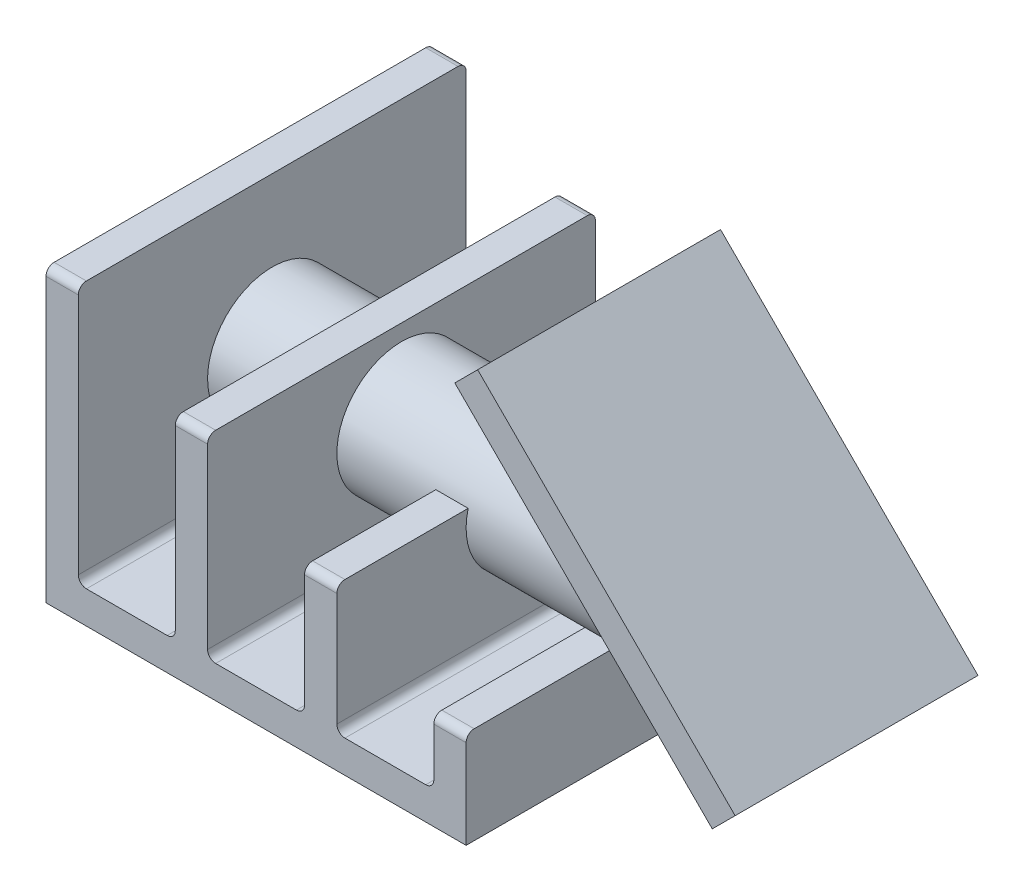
ISO-10303-21;
HEADER;
FILE_DESCRIPTION(('STEP AP214'),'2;1');
FILE_NAME('part.step','',(''),(''),'','','');
FILE_SCHEMA(('AUTOMOTIVE_DESIGN { 1 0 10303 214 1 1 1 1 }'));
ENDSEC;
DATA;
#1=APPLICATION_CONTEXT('core data for automotive mechanical design processes');
#2=APPLICATION_PROTOCOL_DEFINITION('international standard','automotive_design',2000,#1);
#3=PRODUCT_CONTEXT('',#1,'mechanical');
#4=PRODUCT('Part','Part','',(#3));
#5=PRODUCT_RELATED_PRODUCT_CATEGORY('part','',(#4));
#6=PRODUCT_DEFINITION_FORMATION('','',#4);
#7=PRODUCT_DEFINITION_CONTEXT('part definition',#1,'design');
#8=PRODUCT_DEFINITION('design','',#6,#7);
#9=PRODUCT_DEFINITION_SHAPE('','',#8);
#10=(LENGTH_UNIT() NAMED_UNIT(*) SI_UNIT(.MILLI.,.METRE.));
#11=(NAMED_UNIT(*) PLANE_ANGLE_UNIT() SI_UNIT($,.RADIAN.));
#12=(NAMED_UNIT(*) SI_UNIT($,.STERADIAN.) SOLID_ANGLE_UNIT());
#13=UNCERTAINTY_MEASURE_WITH_UNIT(LENGTH_MEASURE(1.E-05),#10,'distance_accuracy_value','');
#14=(GEOMETRIC_REPRESENTATION_CONTEXT(3) GLOBAL_UNCERTAINTY_ASSIGNED_CONTEXT((#13)) GLOBAL_UNIT_ASSIGNED_CONTEXT((#10,
#11,#12)) REPRESENTATION_CONTEXT('',''));
#15=CARTESIAN_POINT('',(0.,0.,0.));
#16=DIRECTION('',(0.,0.,1.));
#17=DIRECTION('',(1.,0.,0.));
#18=AXIS2_PLACEMENT_3D('',#15,#16,#17);
#19=CARTESIAN_POINT('',(140.268496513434,134.77355245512,-29.3702963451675));
#20=DIRECTION('',(0.,0.,-1.));
#21=DIRECTION('',(-1.,0.,0.));
#22=AXIS2_PLACEMENT_3D('',#19,#20,#21);
#23=PLANE('',#22);
#24=DIRECTION('',(0.707106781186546,-0.707106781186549,0.));
#25=VECTOR('',#24,1.);
#26=CARTESIAN_POINT('',(131.288240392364,125.793296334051,-29.3702963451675));
#27=LINE('',#26,#25);
#28=CARTESIAN_POINT('',(131.288240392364,125.793296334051,-29.3702963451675));
#29=VERTEX_POINT('',#28);
#30=CARTESIAN_POINT('',(232.47228169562,24.6092550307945,-29.3702963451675));
#31=VERTEX_POINT('',#30);
#32=EDGE_CURVE('E104',#29,#31,#27,.T.);
#33=ORIENTED_EDGE('',*,*,#32,.T.);
#34=DIRECTION('',(-0.707106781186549,-0.707106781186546,0.));
#35=VECTOR('',#34,1.);
#36=CARTESIAN_POINT('',(241.452537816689,33.5895111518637,-29.3702963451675));
#37=LINE('',#36,#35);
#38=CARTESIAN_POINT('',(241.452537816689,33.5895111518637,-29.3702963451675));
#39=VERTEX_POINT('',#38);
#40=EDGE_CURVE('E12',#39,#31,#37,.T.);
#41=ORIENTED_EDGE('',*,*,#40,.F.);
#42=DIRECTION('',(0.707106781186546,-0.707106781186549,0.));
#43=VECTOR('',#42,1.);
#44=CARTESIAN_POINT('',(140.268496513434,134.77355245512,-29.3702963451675));
#45=LINE('',#44,#43);
#46=CARTESIAN_POINT('',(140.268496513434,134.77355245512,-29.3702963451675));
#47=VERTEX_POINT('',#46);
#48=EDGE_CURVE('E92',#47,#39,#45,.T.);
#49=ORIENTED_EDGE('',*,*,#48,.F.);
#50=DIRECTION('',(-0.707106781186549,-0.707106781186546,0.));
#51=VECTOR('',#50,1.);
#52=CARTESIAN_POINT('',(140.268496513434,134.77355245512,-29.3702963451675));
#53=LINE('',#52,#51);
#54=EDGE_CURVE('E100',#47,#29,#53,.T.);
#55=ORIENTED_EDGE('',*,*,#54,.T.);
#56=EDGE_LOOP('',(#33,#41,#49,#55));
#57=FACE_BOUND('',#56,.T.);
#58=ADVANCED_FACE('F41',(#57),#23,.F.);
#59=CARTESIAN_POINT('',(241.452537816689,33.5895111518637,-29.3702963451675));
#60=DIRECTION('',(-0.707106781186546,0.707106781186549,0.));
#61=DIRECTION('',(-0.707106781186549,-0.707106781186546,0.));
#62=AXIS2_PLACEMENT_3D('',#59,#60,#61);
#63=PLANE('',#62);
#64=DIRECTION('',(0.,0.,-1.));
#65=VECTOR('',#64,1.);
#66=CARTESIAN_POINT('',(232.47228169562,24.6092550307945,-29.3702963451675));
#67=LINE('',#66,#65);
#68=CARTESIAN_POINT('',(232.47228169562,24.6092550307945,-124.813692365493));
#69=VERTEX_POINT('',#68);
#70=EDGE_CURVE('E96',#31,#69,#67,.T.);
#71=ORIENTED_EDGE('',*,*,#70,.T.);
#72=DIRECTION('',(-0.707106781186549,-0.707106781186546,0.));
#73=VECTOR('',#72,1.);
#74=CARTESIAN_POINT('',(241.452537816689,33.5895111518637,-124.813692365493));
#75=LINE('',#74,#73);
#76=CARTESIAN_POINT('',(241.452537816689,33.5895111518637,-124.813692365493));
#77=VERTEX_POINT('',#76);
#78=EDGE_CURVE('E49',#77,#69,#75,.T.);
#79=ORIENTED_EDGE('',*,*,#78,.F.);
#80=DIRECTION('',(0.,0.,-1.));
#81=VECTOR('',#80,1.);
#82=CARTESIAN_POINT('',(241.452537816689,33.5895111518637,-29.3702963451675));
#83=LINE('',#82,#81);
#84=EDGE_CURVE('E87',#39,#77,#83,.T.);
#85=ORIENTED_EDGE('',*,*,#84,.F.);
#86=ORIENTED_EDGE('',*,*,#40,.T.);
#87=EDGE_LOOP('',(#71,#79,#85,#86));
#88=FACE_BOUND('',#87,.T.);
#89=ADVANCED_FACE('F95',(#88),#63,.F.);
#90=CARTESIAN_POINT('',(140.268496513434,134.77355245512,-124.813692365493));
#91=DIRECTION('',(0.,0.,1.));
#92=DIRECTION('',(1.,0.,0.));
#93=AXIS2_PLACEMENT_3D('',#90,#91,#92);
#94=PLANE('',#93);
#95=DIRECTION('',(-0.707106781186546,0.707106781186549,0.));
#96=VECTOR('',#95,1.);
#97=CARTESIAN_POINT('',(131.288240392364,125.793296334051,-124.813692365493));
#98=LINE('',#97,#96);
#99=CARTESIAN_POINT('',(131.288240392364,125.793296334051,-124.813692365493));
#100=VERTEX_POINT('',#99);
#101=EDGE_CURVE('E74',#69,#100,#98,.T.);
#102=ORIENTED_EDGE('',*,*,#101,.T.);
#103=DIRECTION('',(-0.707106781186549,-0.707106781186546,0.));
#104=VECTOR('',#103,1.);
#105=CARTESIAN_POINT('',(140.268496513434,134.77355245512,-124.813692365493));
#106=LINE('',#105,#104);
#107=CARTESIAN_POINT('',(140.268496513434,134.77355245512,-124.813692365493));
#108=VERTEX_POINT('',#107);
#109=EDGE_CURVE('E97',#108,#100,#106,.T.);
#110=ORIENTED_EDGE('',*,*,#109,.F.);
#111=DIRECTION('',(-0.707106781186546,0.707106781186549,0.));
#112=VECTOR('',#111,1.);
#113=CARTESIAN_POINT('',(140.268496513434,134.77355245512,-124.813692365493));
#114=LINE('',#113,#112);
#115=EDGE_CURVE('E90',#77,#108,#114,.T.);
#116=ORIENTED_EDGE('',*,*,#115,.F.);
#117=ORIENTED_EDGE('',*,*,#78,.T.);
#118=EDGE_LOOP('',(#102,#110,#116,#117));
#119=FACE_BOUND('',#118,.T.);
#120=ADVANCED_FACE('F98',(#119),#94,.F.);
#121=CARTESIAN_POINT('',(140.268496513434,134.77355245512,-29.3702963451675));
#122=DIRECTION('',(0.707106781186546,-0.707106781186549,0.));
#123=DIRECTION('',(0.707106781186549,0.707106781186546,0.));
#124=AXIS2_PLACEMENT_3D('',#121,#122,#123);
#125=PLANE('',#124);
#126=DIRECTION('',(0.,0.,1.));
#127=VECTOR('',#126,1.);
#128=CARTESIAN_POINT('',(131.288240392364,125.793296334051,-29.3702963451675));
#129=LINE('',#128,#127);
#130=EDGE_CURVE('E80',#100,#29,#129,.T.);
#131=ORIENTED_EDGE('',*,*,#130,.T.);
#132=ORIENTED_EDGE('',*,*,#54,.F.);
#133=DIRECTION('',(0.,0.,1.));
#134=VECTOR('',#133,1.);
#135=CARTESIAN_POINT('',(140.268496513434,134.77355245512,-29.3702963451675));
#136=LINE('',#135,#134);
#137=EDGE_CURVE('E57',#108,#47,#136,.T.);
#138=ORIENTED_EDGE('',*,*,#137,.F.);
#139=ORIENTED_EDGE('',*,*,#109,.T.);
#140=EDGE_LOOP('',(#131,#132,#138,#139));
#141=FACE_BOUND('',#140,.T.);
#142=ADVANCED_FACE('F111',(#141),#125,.F.);
#143=CARTESIAN_POINT('',(241.452537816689,33.5895111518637,-29.3702963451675));
#144=DIRECTION('',(0.707106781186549,0.707106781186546,0.));
#145=DIRECTION('',(-0.707106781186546,0.707106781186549,0.));
#146=AXIS2_PLACEMENT_3D('',#143,#144,#145);
#147=PLANE('',#146);
#148=ORIENTED_EDGE('',*,*,#48,.T.);
#149=ORIENTED_EDGE('',*,*,#84,.T.);
#150=ORIENTED_EDGE('',*,*,#115,.T.);
#151=ORIENTED_EDGE('',*,*,#137,.T.);
#152=EDGE_LOOP('',(#148,#149,#150,#151));
#153=FACE_BOUND('',#152,.T.);
#154=ADVANCED_FACE('F88',(#153),#147,.T.);
#155=CARTESIAN_POINT('',(232.47228169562,24.6092550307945,-29.3702963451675));
#156=DIRECTION('',(0.707106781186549,0.707106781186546,0.));
#157=DIRECTION('',(-0.707106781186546,0.707106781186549,0.));
#158=AXIS2_PLACEMENT_3D('',#155,#156,#157);
#159=PLANE('',#158);
#160=ORIENTED_EDGE('',*,*,#32,.F.);
#161=ORIENTED_EDGE('',*,*,#130,.F.);
#162=ORIENTED_EDGE('',*,*,#101,.F.);
#163=ORIENTED_EDGE('',*,*,#70,.F.);
#164=EDGE_LOOP('',(#160,#161,#162,#163));
#165=FACE_BOUND('',#164,.T.);
#166=ADVANCED_FACE('F114',(#165),#159,.F.);
#167=CLOSED_SHELL('',(#58,#89,#120,#142,#154,#166));
#168=MANIFOLD_SOLID_BREP('B2',#167);
#169=CARTESIAN_POINT('',(12.7,114.3,-152.4));
#170=DIRECTION('',(1.,0.,0.));
#171=DIRECTION('',(0.,1.,0.));
#172=AXIS2_PLACEMENT_3D('',#169,#170,#171);
#173=PLANE('',#172);
#174=DIRECTION('',(0.,1.,0.));
#175=VECTOR('',#174,1.);
#176=CARTESIAN_POINT('',(12.7,114.3,-152.4));
#177=LINE('',#176,#175);
#178=CARTESIAN_POINT('',(12.7,15.875,-152.4));
#179=VERTEX_POINT('',#178);
#180=CARTESIAN_POINT('',(12.7,111.125,-152.4));
#181=VERTEX_POINT('',#180);
#182=EDGE_CURVE('E468',#179,#181,#177,.T.);
#183=ORIENTED_EDGE('',*,*,#182,.T.);
#184=CARTESIAN_POINT('',(12.7,111.125,-149.225));
#185=DIRECTION('',(1.,0.,0.));
#186=DIRECTION('',(0.,1.,0.));
#187=AXIS2_PLACEMENT_3D('',#184,#185,#186);
#188=CIRCLE('',#187,3.175);
#189=CARTESIAN_POINT('',(12.7,114.3,-149.225));
#190=VERTEX_POINT('',#189);
#191=EDGE_CURVE('E549',#181,#190,#188,.T.);
#192=ORIENTED_EDGE('',*,*,#191,.T.);
#193=DIRECTION('',(0.,0.,1.));
#194=VECTOR('',#193,1.);
#195=CARTESIAN_POINT('',(12.7,114.3,-152.4));
#196=LINE('',#195,#194);
#197=CARTESIAN_POINT('',(12.7,114.3,-3.17500000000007));
#198=VERTEX_POINT('',#197);
#199=EDGE_CURVE('E512',#190,#198,#196,.T.);
#200=ORIENTED_EDGE('',*,*,#199,.T.);
#201=CARTESIAN_POINT('',(12.7,111.125,-3.175));
#202=DIRECTION('',(1.,0.,0.));
#203=DIRECTION('',(0.,1.,0.));
#204=AXIS2_PLACEMENT_3D('',#201,#202,#203);
#205=CIRCLE('',#204,3.175);
#206=CARTESIAN_POINT('',(12.7,111.125,0.));
#207=VERTEX_POINT('',#206);
#208=EDGE_CURVE('E547',#198,#207,#205,.T.);
#209=ORIENTED_EDGE('',*,*,#208,.T.);
#210=DIRECTION('',(0.,1.,0.));
#211=VECTOR('',#210,1.);
#212=CARTESIAN_POINT('',(12.7,114.3,0.));
#213=LINE('',#212,#211);
#214=CARTESIAN_POINT('',(12.7,15.875,0.));
#215=VERTEX_POINT('',#214);
#216=EDGE_CURVE('E501',#215,#207,#213,.T.);
#217=ORIENTED_EDGE('',*,*,#216,.F.);
#218=DIRECTION('',(0.,0.,1.));
#219=VECTOR('',#218,1.);
#220=CARTESIAN_POINT('',(12.7,15.875,-152.4));
#221=LINE('',#220,#219);
#222=EDGE_CURVE('E545',#215,#179,#221,.F.);
#223=ORIENTED_EDGE('',*,*,#222,.T.);
#224=EDGE_LOOP('',(#183,#192,#200,#209,#217,#223));
#225=FACE_BOUND('',#224,.T.);
#226=CARTESIAN_POINT('',(12.7,57.15,-76.2));
#227=DIRECTION('',(1.,0.,0.));
#228=DIRECTION('',(0.,1.,0.));
#229=AXIS2_PLACEMENT_3D('',#226,#227,#228);
#230=CIRCLE('',#229,25.4);
#231=CARTESIAN_POINT('',(12.7,31.75,-76.2));
#232=VERTEX_POINT('',#231);
#233=EDGE_CURVE('E409',#232,#232,#230,.T.);
#234=ORIENTED_EDGE('',*,*,#233,.F.);
#235=EDGE_LOOP('',(#234));
#236=FACE_BOUND('',#235,.T.);
#237=ADVANCED_FACE('F165',(#225,#236),#173,.T.);
#238=CARTESIAN_POINT('',(50.8,12.7,-152.4));
#239=DIRECTION('',(-1.,0.,0.));
#240=DIRECTION('',(0.,0.,1.));
#241=AXIS2_PLACEMENT_3D('',#238,#239,#240);
#242=PLANE('',#241);
#243=DIRECTION('',(0.,0.,1.));
#244=VECTOR('',#243,1.);
#245=CARTESIAN_POINT('',(50.8,88.9,-152.4));
#246=LINE('',#245,#244);
#247=CARTESIAN_POINT('',(50.8,88.9,-149.225));
#248=VERTEX_POINT('',#247);
#249=CARTESIAN_POINT('',(50.8,88.9,-3.17500000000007));
#250=VERTEX_POINT('',#249);
#251=EDGE_CURVE('E515',#248,#250,#246,.T.);
#252=ORIENTED_EDGE('',*,*,#251,.F.);
#253=CARTESIAN_POINT('',(50.8,85.725,-149.225));
#254=DIRECTION('',(-1.,0.,0.));
#255=DIRECTION('',(0.,0.,1.));
#256=AXIS2_PLACEMENT_3D('',#253,#254,#255);
#257=CIRCLE('',#256,3.175);
#258=CARTESIAN_POINT('',(50.8,85.725,-152.4));
#259=VERTEX_POINT('',#258);
#260=EDGE_CURVE('E561',#248,#259,#257,.T.);
#261=ORIENTED_EDGE('',*,*,#260,.T.);
#262=DIRECTION('',(0.,-1.,0.));
#263=VECTOR('',#262,1.);
#264=CARTESIAN_POINT('',(50.8,12.7,-152.4));
#265=LINE('',#264,#263);
#266=CARTESIAN_POINT('',(50.8,15.875,-152.4));
#267=VERTEX_POINT('',#266);
#268=EDGE_CURVE('E462',#259,#267,#265,.T.);
#269=ORIENTED_EDGE('',*,*,#268,.T.);
#270=DIRECTION('',(0.,0.,1.));
#271=VECTOR('',#270,1.);
#272=CARTESIAN_POINT('',(50.8,15.875,0.));
#273=LINE('',#272,#271);
#274=CARTESIAN_POINT('',(50.8,15.875,0.));
#275=VERTEX_POINT('',#274);
#276=EDGE_CURVE('E556',#267,#275,#273,.T.);
#277=ORIENTED_EDGE('',*,*,#276,.T.);
#278=DIRECTION('',(0.,-1.,0.));
#279=VECTOR('',#278,1.);
#280=CARTESIAN_POINT('',(50.8,12.7,0.));
#281=LINE('',#280,#279);
#282=CARTESIAN_POINT('',(50.8,85.725,0.));
#283=VERTEX_POINT('',#282);
#284=EDGE_CURVE('E497',#283,#275,#281,.T.);
#285=ORIENTED_EDGE('',*,*,#284,.F.);
#286=CARTESIAN_POINT('',(50.8,85.725,-3.175));
#287=DIRECTION('',(-1.,0.,0.));
#288=DIRECTION('',(0.,0.,1.));
#289=AXIS2_PLACEMENT_3D('',#286,#287,#288);
#290=CIRCLE('',#289,3.175);
#291=EDGE_CURVE('E559',#283,#250,#290,.T.);
#292=ORIENTED_EDGE('',*,*,#291,.T.);
#293=EDGE_LOOP('',(#252,#261,#269,#277,#285,#292));
#294=FACE_BOUND('',#293,.T.);
#295=CARTESIAN_POINT('',(50.8,57.15,-76.2));
#296=DIRECTION('',(-1.,0.,0.));
#297=DIRECTION('',(0.,0.,1.));
#298=AXIS2_PLACEMENT_3D('',#295,#296,#297);
#299=CIRCLE('',#298,25.4);
#300=CARTESIAN_POINT('',(50.8,31.75,-76.2));
#301=VERTEX_POINT('',#300);
#302=EDGE_CURVE('E434',#301,#301,#299,.F.);
#303=ORIENTED_EDGE('',*,*,#302,.T.);
#304=EDGE_LOOP('',(#303));
#305=FACE_BOUND('',#304,.T.);
#306=ADVANCED_FACE('F668',(#294,#305),#242,.T.);
#307=CARTESIAN_POINT('',(63.5,88.9,-152.4));
#308=DIRECTION('',(1.,0.,0.));
#309=DIRECTION('',(0.,1.,0.));
#310=AXIS2_PLACEMENT_3D('',#307,#308,#309);
#311=PLANE('',#310);
#312=DIRECTION('',(0.,1.,0.));
#313=VECTOR('',#312,1.);
#314=CARTESIAN_POINT('',(63.5,88.9,-152.4));
#315=LINE('',#314,#313);
#316=CARTESIAN_POINT('',(63.5,15.875,-152.4));
#317=VERTEX_POINT('',#316);
#318=CARTESIAN_POINT('',(63.5,85.725,-152.4));
#319=VERTEX_POINT('',#318);
#320=EDGE_CURVE('E459',#317,#319,#315,.T.);
#321=ORIENTED_EDGE('',*,*,#320,.T.);
#322=CARTESIAN_POINT('',(63.5,85.725,-149.225));
#323=DIRECTION('',(1.,0.,0.));
#324=DIRECTION('',(0.,1.,0.));
#325=AXIS2_PLACEMENT_3D('',#322,#323,#324);
#326=CIRCLE('',#325,3.175);
#327=CARTESIAN_POINT('',(63.5,88.9,-149.225));
#328=VERTEX_POINT('',#327);
#329=EDGE_CURVE('E567',#319,#328,#326,.T.);
#330=ORIENTED_EDGE('',*,*,#329,.T.);
#331=DIRECTION('',(0.,0.,1.));
#332=VECTOR('',#331,1.);
#333=CARTESIAN_POINT('',(63.5,88.9,-152.4));
#334=LINE('',#333,#332);
#335=CARTESIAN_POINT('',(63.5,88.9,-3.17500000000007));
#336=VERTEX_POINT('',#335);
#337=EDGE_CURVE('E518',#328,#336,#334,.T.);
#338=ORIENTED_EDGE('',*,*,#337,.T.);
#339=CARTESIAN_POINT('',(63.5,85.725,-3.175));
#340=DIRECTION('',(1.,0.,0.));
#341=DIRECTION('',(0.,1.,0.));
#342=AXIS2_PLACEMENT_3D('',#339,#340,#341);
#343=CIRCLE('',#342,3.175);
#344=CARTESIAN_POINT('',(63.5,85.725,0.));
#345=VERTEX_POINT('',#344);
#346=EDGE_CURVE('E565',#336,#345,#343,.T.);
#347=ORIENTED_EDGE('',*,*,#346,.T.);
#348=DIRECTION('',(0.,1.,0.));
#349=VECTOR('',#348,1.);
#350=CARTESIAN_POINT('',(63.5,88.9,0.));
#351=LINE('',#350,#349);
#352=CARTESIAN_POINT('',(63.5,15.875,0.));
#353=VERTEX_POINT('',#352);
#354=EDGE_CURVE('E494',#353,#345,#351,.T.);
#355=ORIENTED_EDGE('',*,*,#354,.F.);
#356=DIRECTION('',(0.,0.,1.));
#357=VECTOR('',#356,1.);
#358=CARTESIAN_POINT('',(63.5,15.875,-152.4));
#359=LINE('',#358,#357);
#360=EDGE_CURVE('E563',#353,#317,#359,.F.);
#361=ORIENTED_EDGE('',*,*,#360,.T.);
#362=EDGE_LOOP('',(#321,#330,#338,#347,#355,#361));
#363=FACE_BOUND('',#362,.T.);
#364=CARTESIAN_POINT('',(63.5,57.15,-76.2));
#365=DIRECTION('',(1.,0.,0.));
#366=DIRECTION('',(0.,1.,0.));
#367=AXIS2_PLACEMENT_3D('',#364,#365,#366);
#368=CIRCLE('',#367,25.4);
#369=CARTESIAN_POINT('',(63.5,82.55,-76.2));
#370=VERTEX_POINT('',#369);
#371=EDGE_CURVE('E431',#370,#370,#368,.F.);
#372=ORIENTED_EDGE('',*,*,#371,.T.);
#373=EDGE_LOOP('',(#372));
#374=FACE_BOUND('',#373,.T.);
#375=ADVANCED_FACE('F681',(#363,#374),#311,.T.);
#376=CARTESIAN_POINT('',(101.6,12.7,-152.4));
#377=DIRECTION('',(-1.,0.,0.));
#378=DIRECTION('',(0.,0.,1.));
#379=AXIS2_PLACEMENT_3D('',#376,#377,#378);
#380=PLANE('',#379);
#381=DIRECTION('',(0.,0.,1.));
#382=VECTOR('',#381,1.);
#383=CARTESIAN_POINT('',(101.6,63.5,-152.4));
#384=LINE('',#383,#382);
#385=CARTESIAN_POINT('',(101.6,63.5,-149.225));
#386=VERTEX_POINT('',#385);
#387=CARTESIAN_POINT('',(101.6,63.5000000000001,-100.793444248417));
#388=VERTEX_POINT('',#387);
#389=EDGE_CURVE('E521',#386,#388,#384,.T.);
#390=ORIENTED_EDGE('',*,*,#389,.F.);
#391=CARTESIAN_POINT('',(101.6,60.325,-149.225));
#392=DIRECTION('',(-1.,0.,0.));
#393=DIRECTION('',(0.,0.,1.));
#394=AXIS2_PLACEMENT_3D('',#391,#392,#393);
#395=CIRCLE('',#394,3.175);
#396=CARTESIAN_POINT('',(101.6,60.325,-152.4));
#397=VERTEX_POINT('',#396);
#398=EDGE_CURVE('E577',#386,#397,#395,.T.);
#399=ORIENTED_EDGE('',*,*,#398,.T.);
#400=DIRECTION('',(0.,-1.,0.));
#401=VECTOR('',#400,1.);
#402=CARTESIAN_POINT('',(101.6,12.7,-152.4));
#403=LINE('',#402,#401);
#404=CARTESIAN_POINT('',(101.6,15.875,-152.4));
#405=VERTEX_POINT('',#404);
#406=EDGE_CURVE('E453',#397,#405,#403,.T.);
#407=ORIENTED_EDGE('',*,*,#406,.T.);
#408=DIRECTION('',(0.,0.,1.));
#409=VECTOR('',#408,1.);
#410=CARTESIAN_POINT('',(101.6,15.875,0.));
#411=LINE('',#410,#409);
#412=CARTESIAN_POINT('',(101.6,15.875,0.));
#413=VERTEX_POINT('',#412);
#414=EDGE_CURVE('E572',#405,#413,#411,.T.);
#415=ORIENTED_EDGE('',*,*,#414,.T.);
#416=DIRECTION('',(0.,-1.,0.));
#417=VECTOR('',#416,1.);
#418=CARTESIAN_POINT('',(101.6,12.7,0.));
#419=LINE('',#418,#417);
#420=CARTESIAN_POINT('',(101.6,60.325,0.));
#421=VERTEX_POINT('',#420);
#422=EDGE_CURVE('E488',#421,#413,#419,.T.);
#423=ORIENTED_EDGE('',*,*,#422,.F.);
#424=CARTESIAN_POINT('',(101.6,60.325,-3.175));
#425=DIRECTION('',(-1.,0.,0.));
#426=DIRECTION('',(0.,0.,1.));
#427=AXIS2_PLACEMENT_3D('',#424,#425,#426);
#428=CIRCLE('',#427,3.175);
#429=CARTESIAN_POINT('',(101.6,63.5,-3.17500000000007));
#430=VERTEX_POINT('',#429);
#431=EDGE_CURVE('E575',#421,#430,#428,.T.);
#432=ORIENTED_EDGE('',*,*,#431,.T.);
#433=CARTESIAN_POINT('',(101.6,63.5000000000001,-51.6065557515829));
#434=VERTEX_POINT('',#433);
#435=EDGE_CURVE('E523',#434,#430,#384,.T.);
#436=ORIENTED_EDGE('',*,*,#435,.F.);
#437=CARTESIAN_POINT('',(101.6,57.15,-76.2));
#438=DIRECTION('',(-1.,0.,0.));
#439=DIRECTION('',(0.,0.,1.));
#440=AXIS2_PLACEMENT_3D('',#437,#438,#439);
#441=CIRCLE('',#440,25.4);
#442=EDGE_CURVE('E428',#434,#388,#441,.F.);
#443=ORIENTED_EDGE('',*,*,#442,.T.);
#444=EDGE_LOOP('',(#390,#399,#407,#415,#423,#432,#436,#443));
#445=FACE_BOUND('',#444,.T.);
#446=ADVANCED_FACE('F706',(#445),#380,.T.);
#447=CARTESIAN_POINT('',(101.6,63.5,-152.4));
#448=DIRECTION('',(0.,1.,0.));
#449=DIRECTION('',(-1.,0.,0.));
#450=AXIS2_PLACEMENT_3D('',#447,#448,#449);
#451=PLANE('',#450);
#452=DIRECTION('',(0.,0.,1.));
#453=VECTOR('',#452,1.);
#454=CARTESIAN_POINT('',(114.3,63.5,-152.4));
#455=LINE('',#454,#453);
#456=CARTESIAN_POINT('',(114.3,63.5,-149.225));
#457=VERTEX_POINT('',#456);
#458=CARTESIAN_POINT('',(114.3,63.5,-100.793444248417));
#459=VERTEX_POINT('',#458);
#460=EDGE_CURVE('E524',#457,#459,#455,.T.);
#461=ORIENTED_EDGE('',*,*,#460,.F.);
#462=DIRECTION('',(-1.,0.,0.));
#463=VECTOR('',#462,1.);
#464=CARTESIAN_POINT('',(101.6,63.5,-149.225));
#465=LINE('',#464,#463);
#466=EDGE_CURVE('E569',#457,#386,#465,.T.);
#467=ORIENTED_EDGE('',*,*,#466,.T.);
#468=ORIENTED_EDGE('',*,*,#389,.T.);
#469=DIRECTION('',(-1.,0.,0.));
#470=VECTOR('',#469,1.);
#471=CARTESIAN_POINT('',(165.1,63.5000000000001,-100.793444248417));
#472=LINE('',#471,#470);
#473=EDGE_CURVE('E425',#388,#459,#472,.F.);
#474=ORIENTED_EDGE('',*,*,#473,.T.);
#475=EDGE_LOOP('',(#461,#467,#468,#474));
#476=FACE_BOUND('',#475,.T.);
#477=ADVANCED_FACE('F714',(#476),#451,.T.);
#478=ORIENTED_EDGE('',*,*,#435,.T.);
#479=DIRECTION('',(-1.,0.,0.));
#480=VECTOR('',#479,1.);
#481=CARTESIAN_POINT('',(114.3,63.5,-3.175));
#482=LINE('',#481,#480);
#483=CARTESIAN_POINT('',(114.3,63.5,-3.17500000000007));
#484=VERTEX_POINT('',#483);
#485=EDGE_CURVE('E611',#430,#484,#482,.F.);
#486=ORIENTED_EDGE('',*,*,#485,.T.);
#487=CARTESIAN_POINT('',(114.3,63.5,-51.6065557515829));
#488=VERTEX_POINT('',#487);
#489=EDGE_CURVE('E526',#488,#484,#455,.T.);
#490=ORIENTED_EDGE('',*,*,#489,.F.);
#491=DIRECTION('',(-1.,0.,0.));
#492=VECTOR('',#491,1.);
#493=CARTESIAN_POINT('',(165.1,63.5000000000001,-51.6065557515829));
#494=LINE('',#493,#492);
#495=EDGE_CURVE('E418',#488,#434,#494,.T.);
#496=ORIENTED_EDGE('',*,*,#495,.T.);
#497=EDGE_LOOP('',(#478,#486,#490,#496));
#498=FACE_BOUND('',#497,.T.);
#499=ADVANCED_FACE('F725',(#498),#451,.T.);
#500=CARTESIAN_POINT('',(114.3,63.5,-152.4));
#501=DIRECTION('',(1.,0.,0.));
#502=DIRECTION('',(0.,0.,-1.));
#503=AXIS2_PLACEMENT_3D('',#500,#501,#502);
#504=PLANE('',#503);
#505=DIRECTION('',(0.,1.,0.));
#506=VECTOR('',#505,1.);
#507=CARTESIAN_POINT('',(114.3,63.5,-152.4));
#508=LINE('',#507,#506);
#509=CARTESIAN_POINT('',(114.3,15.875,-152.4));
#510=VERTEX_POINT('',#509);
#511=CARTESIAN_POINT('',(114.3,60.325,-152.4));
#512=VERTEX_POINT('',#511);
#513=EDGE_CURVE('E450',#510,#512,#508,.T.);
#514=ORIENTED_EDGE('',*,*,#513,.T.);
#515=CARTESIAN_POINT('',(114.3,60.325,-149.225));
#516=DIRECTION('',(1.,0.,0.));
#517=DIRECTION('',(0.,0.,-1.));
#518=AXIS2_PLACEMENT_3D('',#515,#516,#517);
#519=CIRCLE('',#518,3.175);
#520=EDGE_CURVE('E583',#512,#457,#519,.T.);
#521=ORIENTED_EDGE('',*,*,#520,.T.);
#522=ORIENTED_EDGE('',*,*,#460,.T.);
#523=CARTESIAN_POINT('',(114.3,57.15,-76.2));
#524=DIRECTION('',(1.,0.,0.));
#525=DIRECTION('',(0.,0.,-1.));
#526=AXIS2_PLACEMENT_3D('',#523,#524,#525);
#527=CIRCLE('',#526,25.4);
#528=EDGE_CURVE('E414',#459,#488,#527,.F.);
#529=ORIENTED_EDGE('',*,*,#528,.T.);
#530=ORIENTED_EDGE('',*,*,#489,.T.);
#531=CARTESIAN_POINT('',(114.3,60.325,-3.175));
#532=DIRECTION('',(1.,0.,0.));
#533=DIRECTION('',(0.,0.,-1.));
#534=AXIS2_PLACEMENT_3D('',#531,#532,#533);
#535=CIRCLE('',#534,3.175);
#536=CARTESIAN_POINT('',(114.3,60.325,0.));
#537=VERTEX_POINT('',#536);
#538=EDGE_CURVE('E581',#484,#537,#535,.T.);
#539=ORIENTED_EDGE('',*,*,#538,.T.);
#540=DIRECTION('',(0.,1.,0.));
#541=VECTOR('',#540,1.);
#542=CARTESIAN_POINT('',(114.3,63.5,0.));
#543=LINE('',#542,#541);
#544=CARTESIAN_POINT('',(114.3,15.875,0.));
#545=VERTEX_POINT('',#544);
#546=EDGE_CURVE('E485',#545,#537,#543,.T.);
#547=ORIENTED_EDGE('',*,*,#546,.F.);
#548=DIRECTION('',(0.,0.,1.));
#549=VECTOR('',#548,1.);
#550=CARTESIAN_POINT('',(114.3,15.875,-152.4));
#551=LINE('',#550,#549);
#552=EDGE_CURVE('E579',#545,#510,#551,.F.);
#553=ORIENTED_EDGE('',*,*,#552,.T.);
#554=EDGE_LOOP('',(#514,#521,#522,#529,#530,#539,#547,#553));
#555=FACE_BOUND('',#554,.T.);
#556=ADVANCED_FACE('F718',(#555),#504,.T.);
#557=CARTESIAN_POINT('',(152.4,12.7,-152.4));
#558=DIRECTION('',(-1.,0.,0.));
#559=DIRECTION('',(0.,0.,1.));
#560=AXIS2_PLACEMENT_3D('',#557,#558,#559);
#561=PLANE('',#560);
#562=DIRECTION('',(0.,0.,1.));
#563=VECTOR('',#562,1.);
#564=CARTESIAN_POINT('',(152.4,38.1,-152.4));
#565=LINE('',#564,#563);
#566=CARTESIAN_POINT('',(152.4,38.1,-149.225));
#567=VERTEX_POINT('',#566);
#568=CARTESIAN_POINT('',(152.4,38.1,-93.0005208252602));
#569=VERTEX_POINT('',#568);
#570=EDGE_CURVE('E413',#567,#569,#565,.T.);
#571=ORIENTED_EDGE('',*,*,#570,.F.);
#572=CARTESIAN_POINT('',(152.4,34.925,-149.225));
#573=DIRECTION('',(-1.,0.,0.));
#574=DIRECTION('',(0.,0.,1.));
#575=AXIS2_PLACEMENT_3D('',#572,#573,#574);
#576=CIRCLE('',#575,3.175);
#577=CARTESIAN_POINT('',(152.4,34.925,-152.4));
#578=VERTEX_POINT('',#577);
#579=EDGE_CURVE('E592',#567,#578,#576,.T.);
#580=ORIENTED_EDGE('',*,*,#579,.T.);
#581=DIRECTION('',(0.,-1.,0.));
#582=VECTOR('',#581,1.);
#583=CARTESIAN_POINT('',(152.4,12.7,-152.4));
#584=LINE('',#583,#582);
#585=CARTESIAN_POINT('',(152.4,15.875,-152.4));
#586=VERTEX_POINT('',#585);
#587=EDGE_CURVE('E444',#578,#586,#584,.T.);
#588=ORIENTED_EDGE('',*,*,#587,.T.);
#589=DIRECTION('',(0.,0.,1.));
#590=VECTOR('',#589,1.);
#591=CARTESIAN_POINT('',(152.4,15.875,0.));
#592=LINE('',#591,#590);
#593=CARTESIAN_POINT('',(152.4,15.875,0.));
#594=VERTEX_POINT('',#593);
#595=EDGE_CURVE('E587',#586,#594,#592,.T.);
#596=ORIENTED_EDGE('',*,*,#595,.T.);
#597=DIRECTION('',(0.,-1.,0.));
#598=VECTOR('',#597,1.);
#599=CARTESIAN_POINT('',(152.4,12.7,0.));
#600=LINE('',#599,#598);
#601=CARTESIAN_POINT('',(152.4,34.925,0.));
#602=VERTEX_POINT('',#601);
#603=EDGE_CURVE('E479',#602,#594,#600,.T.);
#604=ORIENTED_EDGE('',*,*,#603,.F.);
#605=CARTESIAN_POINT('',(152.4,34.925,-3.175));
#606=DIRECTION('',(-1.,0.,0.));
#607=DIRECTION('',(0.,0.,1.));
#608=AXIS2_PLACEMENT_3D('',#605,#606,#607);
#609=CIRCLE('',#608,3.175);
#610=CARTESIAN_POINT('',(152.4,38.1,-3.17500000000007));
#611=VERTEX_POINT('',#610);
#612=EDGE_CURVE('E590',#602,#611,#609,.T.);
#613=ORIENTED_EDGE('',*,*,#612,.T.);
#614=CARTESIAN_POINT('',(152.4,38.1,-59.3994791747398));
#615=VERTEX_POINT('',#614);
#616=EDGE_CURVE('E398',#615,#611,#565,.T.);
#617=ORIENTED_EDGE('',*,*,#616,.F.);
#618=CARTESIAN_POINT('',(152.4,57.15,-76.2));
#619=DIRECTION('',(-1.,0.,0.));
#620=DIRECTION('',(0.,0.,1.));
#621=AXIS2_PLACEMENT_3D('',#618,#619,#620);
#622=CIRCLE('',#621,25.4);
#623=EDGE_CURVE('E415',#615,#569,#622,.F.);
#624=ORIENTED_EDGE('',*,*,#623,.T.);
#625=EDGE_LOOP('',(#571,#580,#588,#596,#604,#613,#617,#624));
#626=FACE_BOUND('',#625,.T.);
#627=ADVANCED_FACE('F750',(#626),#561,.T.);
#628=CARTESIAN_POINT('',(152.4,38.1,-152.4));
#629=DIRECTION('',(0.,1.,0.));
#630=DIRECTION('',(-1.,0.,0.));
#631=AXIS2_PLACEMENT_3D('',#628,#629,#630);
#632=PLANE('',#631);
#633=DIRECTION('',(0.,0.,1.));
#634=VECTOR('',#633,1.);
#635=CARTESIAN_POINT('',(165.1,38.1,-152.4));
#636=LINE('',#635,#634);
#637=CARTESIAN_POINT('',(165.1,38.1,-149.225));
#638=VERTEX_POINT('',#637);
#639=CARTESIAN_POINT('',(165.1,38.1,-93.0005208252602));
#640=VERTEX_POINT('',#639);
#641=EDGE_CURVE('E385',#638,#640,#636,.T.);
#642=ORIENTED_EDGE('',*,*,#641,.F.);
#643=DIRECTION('',(-1.,0.,0.));
#644=VECTOR('',#643,1.);
#645=CARTESIAN_POINT('',(152.4,38.1,-149.225));
#646=LINE('',#645,#644);
#647=EDGE_CURVE('E585',#638,#567,#646,.T.);
#648=ORIENTED_EDGE('',*,*,#647,.T.);
#649=ORIENTED_EDGE('',*,*,#570,.T.);
#650=DIRECTION('',(-1.,0.,0.));
#651=VECTOR('',#650,1.);
#652=CARTESIAN_POINT('',(165.1,38.1,-93.0005208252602));
#653=LINE('',#652,#651);
#654=EDGE_CURVE('E404',#569,#640,#653,.F.);
#655=ORIENTED_EDGE('',*,*,#654,.T.);
#656=EDGE_LOOP('',(#642,#648,#649,#655));
#657=FACE_BOUND('',#656,.T.);
#658=ADVANCED_FACE('F411',(#657),#632,.T.);
#659=ORIENTED_EDGE('',*,*,#616,.T.);
#660=DIRECTION('',(-1.,0.,0.));
#661=VECTOR('',#660,1.);
#662=CARTESIAN_POINT('',(165.1,38.1,-3.175));
#663=LINE('',#662,#661);
#664=CARTESIAN_POINT('',(165.1,38.1,-3.17500000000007));
#665=VERTEX_POINT('',#664);
#666=EDGE_CURVE('E609',#611,#665,#663,.F.);
#667=ORIENTED_EDGE('',*,*,#666,.T.);
#668=CARTESIAN_POINT('',(165.1,38.1,-59.3994791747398));
#669=VERTEX_POINT('',#668);
#670=EDGE_CURVE('E399',#669,#665,#636,.T.);
#671=ORIENTED_EDGE('',*,*,#670,.F.);
#672=DIRECTION('',(-1.,0.,0.));
#673=VECTOR('',#672,1.);
#674=CARTESIAN_POINT('',(165.1,38.1,-59.3994791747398));
#675=LINE('',#674,#673);
#676=EDGE_CURVE('E407',#669,#615,#675,.T.);
#677=ORIENTED_EDGE('',*,*,#676,.T.);
#678=EDGE_LOOP('',(#659,#667,#671,#677));
#679=FACE_BOUND('',#678,.T.);
#680=ADVANCED_FACE('F783',(#679),#632,.T.);
#681=CARTESIAN_POINT('',(165.1,0.,-152.4));
#682=DIRECTION('',(0.,-1.,0.));
#683=DIRECTION('',(1.,0.,0.));
#684=AXIS2_PLACEMENT_3D('',#681,#682,#683);
#685=PLANE('',#684);
#686=DIRECTION('',(1.,0.,0.));
#687=VECTOR('',#686,1.);
#688=CARTESIAN_POINT('',(165.1,0.,0.));
#689=LINE('',#688,#687);
#690=CARTESIAN_POINT('',(0.,0.,0.));
#691=VERTEX_POINT('',#690);
#692=CARTESIAN_POINT('',(165.1,0.,0.));
#693=VERTEX_POINT('',#692);
#694=EDGE_CURVE('E437',#691,#693,#689,.T.);
#695=ORIENTED_EDGE('',*,*,#694,.F.);
#696=DIRECTION('',(0.,0.,1.));
#697=VECTOR('',#696,1.);
#698=CARTESIAN_POINT('',(0.,0.,-152.4));
#699=LINE('',#698,#697);
#700=CARTESIAN_POINT('',(0.,0.,-152.4));
#701=VERTEX_POINT('',#700);
#702=EDGE_CURVE('E505',#701,#691,#699,.T.);
#703=ORIENTED_EDGE('',*,*,#702,.F.);
#704=DIRECTION('',(1.,0.,0.));
#705=VECTOR('',#704,1.);
#706=CARTESIAN_POINT('',(165.1,0.,-152.4));
#707=LINE('',#706,#705);
#708=CARTESIAN_POINT('',(165.1,0.,-152.4));
#709=VERTEX_POINT('',#708);
#710=EDGE_CURVE('E438',#701,#709,#707,.T.);
#711=ORIENTED_EDGE('',*,*,#710,.T.);
#712=DIRECTION('',(0.,0.,1.));
#713=VECTOR('',#712,1.);
#714=CARTESIAN_POINT('',(165.1,0.,-152.4));
#715=LINE('',#714,#713);
#716=EDGE_CURVE('E473',#709,#693,#715,.T.);
#717=ORIENTED_EDGE('',*,*,#716,.T.);
#718=EDGE_LOOP('',(#695,#703,#711,#717));
#719=FACE_BOUND('',#718,.T.);
#720=ADVANCED_FACE('F759',(#719),#685,.T.);
#721=CARTESIAN_POINT('',(0.,0.,-152.4));
#722=DIRECTION('',(-1.,0.,0.));
#723=DIRECTION('',(0.,0.,1.));
#724=AXIS2_PLACEMENT_3D('',#721,#722,#723);
#725=PLANE('',#724);
#726=DIRECTION('',(0.,0.,1.));
#727=VECTOR('',#726,1.);
#728=CARTESIAN_POINT('',(0.,114.3,-152.4));
#729=LINE('',#728,#727);
#730=CARTESIAN_POINT('',(0.,114.3,-149.225));
#731=VERTEX_POINT('',#730);
#732=CARTESIAN_POINT('',(0.,114.3,-3.17500000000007));
#733=VERTEX_POINT('',#732);
#734=EDGE_CURVE('E509',#731,#733,#729,.T.);
#735=ORIENTED_EDGE('',*,*,#734,.F.);
#736=CARTESIAN_POINT('',(0.,111.125,-149.225));
#737=DIRECTION('',(-1.,0.,0.));
#738=DIRECTION('',(0.,0.,1.));
#739=AXIS2_PLACEMENT_3D('',#736,#737,#738);
#740=CIRCLE('',#739,3.175);
#741=CARTESIAN_POINT('',(0.,111.125,-152.4));
#742=VERTEX_POINT('',#741);
#743=EDGE_CURVE('E535',#731,#742,#740,.T.);
#744=ORIENTED_EDGE('',*,*,#743,.T.);
#745=DIRECTION('',(0.,-1.,0.));
#746=VECTOR('',#745,1.);
#747=CARTESIAN_POINT('',(0.,0.,-152.4));
#748=LINE('',#747,#746);
#749=EDGE_CURVE('E471',#742,#701,#748,.T.);
#750=ORIENTED_EDGE('',*,*,#749,.T.);
#751=ORIENTED_EDGE('',*,*,#702,.T.);
#752=DIRECTION('',(0.,-1.,0.));
#753=VECTOR('',#752,1.);
#754=CARTESIAN_POINT('',(0.,0.,0.));
#755=LINE('',#754,#753);
#756=CARTESIAN_POINT('',(0.,111.125,0.));
#757=VERTEX_POINT('',#756);
#758=EDGE_CURVE('E442',#757,#691,#755,.T.);
#759=ORIENTED_EDGE('',*,*,#758,.F.);
#760=CARTESIAN_POINT('',(0.,111.125,-3.175));
#761=DIRECTION('',(-1.,0.,0.));
#762=DIRECTION('',(0.,0.,1.));
#763=AXIS2_PLACEMENT_3D('',#760,#761,#762);
#764=CIRCLE('',#763,3.175);
#765=EDGE_CURVE('E533',#757,#733,#764,.T.);
#766=ORIENTED_EDGE('',*,*,#765,.T.);
#767=EDGE_LOOP('',(#735,#744,#750,#751,#759,#766));
#768=FACE_BOUND('',#767,.T.);
#769=ADVANCED_FACE('F775',(#768),#725,.T.);
#770=CARTESIAN_POINT('',(0.,114.3,-152.4));
#771=DIRECTION('',(0.,1.,0.));
#772=DIRECTION('',(0.,0.,1.));
#773=AXIS2_PLACEMENT_3D('',#770,#771,#772);
#774=PLANE('',#773);
#775=ORIENTED_EDGE('',*,*,#199,.F.);
#776=DIRECTION('',(-1.,0.,0.));
#777=VECTOR('',#776,1.);
#778=CARTESIAN_POINT('',(0.,114.3,-149.225));
#779=LINE('',#778,#777);
#780=EDGE_CURVE('E530',#190,#731,#779,.T.);
#781=ORIENTED_EDGE('',*,*,#780,.T.);
#782=ORIENTED_EDGE('',*,*,#734,.T.);
#783=DIRECTION('',(-1.,0.,0.));
#784=VECTOR('',#783,1.);
#785=CARTESIAN_POINT('',(12.7,114.3,-3.175));
#786=LINE('',#785,#784);
#787=EDGE_CURVE('E508',#733,#198,#786,.F.);
#788=ORIENTED_EDGE('',*,*,#787,.T.);
#789=EDGE_LOOP('',(#775,#781,#782,#788));
#790=FACE_BOUND('',#789,.T.);
#791=ADVANCED_FACE('F769',(#790),#774,.T.);
#792=CARTESIAN_POINT('',(12.7,12.7,-152.4));
#793=DIRECTION('',(0.,1.,0.));
#794=DIRECTION('',(0.,0.,1.));
#795=AXIS2_PLACEMENT_3D('',#792,#793,#794);
#796=PLANE('',#795);
#797=DIRECTION('',(-1.,0.,0.));
#798=VECTOR('',#797,1.);
#799=CARTESIAN_POINT('',(12.7,12.7,0.));
#800=LINE('',#799,#798);
#801=CARTESIAN_POINT('',(47.625,12.7,0.));
#802=VERTEX_POINT('',#801);
#803=CARTESIAN_POINT('',(15.875,12.7,0.));
#804=VERTEX_POINT('',#803);
#805=EDGE_CURVE('E499',#802,#804,#800,.T.);
#806=ORIENTED_EDGE('',*,*,#805,.F.);
#807=DIRECTION('',(0.,0.,1.));
#808=VECTOR('',#807,1.);
#809=CARTESIAN_POINT('',(47.625,12.7,-152.4));
#810=LINE('',#809,#808);
#811=CARTESIAN_POINT('',(47.625,12.7,-152.4));
#812=VERTEX_POINT('',#811);
#813=EDGE_CURVE('E625',#802,#812,#810,.F.);
#814=ORIENTED_EDGE('',*,*,#813,.T.);
#815=DIRECTION('',(-1.,0.,0.));
#816=VECTOR('',#815,1.);
#817=CARTESIAN_POINT('',(12.7,12.7,-152.4));
#818=LINE('',#817,#816);
#819=CARTESIAN_POINT('',(15.875,12.7,-152.4));
#820=VERTEX_POINT('',#819);
#821=EDGE_CURVE('E465',#812,#820,#818,.T.);
#822=ORIENTED_EDGE('',*,*,#821,.T.);
#823=DIRECTION('',(0.,0.,1.));
#824=VECTOR('',#823,1.);
#825=CARTESIAN_POINT('',(15.875,12.7,0.));
#826=LINE('',#825,#824);
#827=EDGE_CURVE('E623',#820,#804,#826,.T.);
#828=ORIENTED_EDGE('',*,*,#827,.T.);
#829=EDGE_LOOP('',(#806,#814,#822,#828));
#830=FACE_BOUND('',#829,.T.);
#831=ADVANCED_FACE('F659',(#830),#796,.T.);
#832=CARTESIAN_POINT('',(50.8,88.9,-152.4));
#833=DIRECTION('',(0.,1.,0.));
#834=DIRECTION('',(0.,0.,1.));
#835=AXIS2_PLACEMENT_3D('',#832,#833,#834);
#836=PLANE('',#835);
#837=ORIENTED_EDGE('',*,*,#337,.F.);
#838=DIRECTION('',(-1.,0.,0.));
#839=VECTOR('',#838,1.);
#840=CARTESIAN_POINT('',(50.8,88.9,-149.225));
#841=LINE('',#840,#839);
#842=EDGE_CURVE('E553',#328,#248,#841,.T.);
#843=ORIENTED_EDGE('',*,*,#842,.T.);
#844=ORIENTED_EDGE('',*,*,#251,.T.);
#845=DIRECTION('',(-1.,0.,0.));
#846=VECTOR('',#845,1.);
#847=CARTESIAN_POINT('',(63.5,88.9,-3.175));
#848=LINE('',#847,#846);
#849=EDGE_CURVE('E551',#250,#336,#848,.F.);
#850=ORIENTED_EDGE('',*,*,#849,.T.);
#851=EDGE_LOOP('',(#837,#843,#844,#850));
#852=FACE_BOUND('',#851,.T.);
#853=ADVANCED_FACE('F677',(#852),#836,.T.);
#854=CARTESIAN_POINT('',(63.5,12.7,-152.4));
#855=DIRECTION('',(0.,1.,0.));
#856=DIRECTION('',(-1.,0.,0.));
#857=AXIS2_PLACEMENT_3D('',#854,#855,#856);
#858=PLANE('',#857);
#859=DIRECTION('',(-1.,0.,0.));
#860=VECTOR('',#859,1.);
#861=CARTESIAN_POINT('',(63.5,12.7,0.));
#862=LINE('',#861,#860);
#863=CARTESIAN_POINT('',(98.425,12.7,0.));
#864=VERTEX_POINT('',#863);
#865=CARTESIAN_POINT('',(66.675,12.7,0.));
#866=VERTEX_POINT('',#865);
#867=EDGE_CURVE('E491',#864,#866,#862,.T.);
#868=ORIENTED_EDGE('',*,*,#867,.F.);
#869=DIRECTION('',(0.,0.,1.));
#870=VECTOR('',#869,1.);
#871=CARTESIAN_POINT('',(98.425,12.7,-152.4));
#872=LINE('',#871,#870);
#873=CARTESIAN_POINT('',(98.425,12.7,-152.4));
#874=VERTEX_POINT('',#873);
#875=EDGE_CURVE('E621',#864,#874,#872,.F.);
#876=ORIENTED_EDGE('',*,*,#875,.T.);
#877=DIRECTION('',(-1.,0.,0.));
#878=VECTOR('',#877,1.);
#879=CARTESIAN_POINT('',(63.5,12.7,-152.4));
#880=LINE('',#879,#878);
#881=CARTESIAN_POINT('',(66.675,12.7,-152.4));
#882=VERTEX_POINT('',#881);
#883=EDGE_CURVE('E456',#874,#882,#880,.T.);
#884=ORIENTED_EDGE('',*,*,#883,.T.);
#885=DIRECTION('',(0.,0.,1.));
#886=VECTOR('',#885,1.);
#887=CARTESIAN_POINT('',(66.675,12.7,0.));
#888=LINE('',#887,#886);
#889=EDGE_CURVE('E618',#882,#866,#888,.T.);
#890=ORIENTED_EDGE('',*,*,#889,.T.);
#891=EDGE_LOOP('',(#868,#876,#884,#890));
#892=FACE_BOUND('',#891,.T.);
#893=ADVANCED_FACE('F697',(#892),#858,.T.);
#894=CARTESIAN_POINT('',(114.3,12.7,-152.4));
#895=DIRECTION('',(0.,1.,0.));
#896=DIRECTION('',(-1.,0.,0.));
#897=AXIS2_PLACEMENT_3D('',#894,#895,#896);
#898=PLANE('',#897);
#899=DIRECTION('',(-1.,0.,0.));
#900=VECTOR('',#899,1.);
#901=CARTESIAN_POINT('',(114.3,12.7,0.));
#902=LINE('',#901,#900);
#903=CARTESIAN_POINT('',(149.225,12.7,0.));
#904=VERTEX_POINT('',#903);
#905=CARTESIAN_POINT('',(117.475,12.7,0.));
#906=VERTEX_POINT('',#905);
#907=EDGE_CURVE('E482',#904,#906,#902,.T.);
#908=ORIENTED_EDGE('',*,*,#907,.F.);
#909=DIRECTION('',(0.,0.,1.));
#910=VECTOR('',#909,1.);
#911=CARTESIAN_POINT('',(149.225,12.7,-152.4));
#912=LINE('',#911,#910);
#913=CARTESIAN_POINT('',(149.225,12.7,-152.4));
#914=VERTEX_POINT('',#913);
#915=EDGE_CURVE('E616',#904,#914,#912,.F.);
#916=ORIENTED_EDGE('',*,*,#915,.T.);
#917=DIRECTION('',(-1.,0.,0.));
#918=VECTOR('',#917,1.);
#919=CARTESIAN_POINT('',(114.3,12.7,-152.4));
#920=LINE('',#919,#918);
#921=CARTESIAN_POINT('',(117.475,12.7,-152.4));
#922=VERTEX_POINT('',#921);
#923=EDGE_CURVE('E447',#914,#922,#920,.T.);
#924=ORIENTED_EDGE('',*,*,#923,.T.);
#925=DIRECTION('',(0.,0.,1.));
#926=VECTOR('',#925,1.);
#927=CARTESIAN_POINT('',(117.475,12.7,0.));
#928=LINE('',#927,#926);
#929=EDGE_CURVE('E613',#922,#906,#928,.T.);
#930=ORIENTED_EDGE('',*,*,#929,.T.);
#931=EDGE_LOOP('',(#908,#916,#924,#930));
#932=FACE_BOUND('',#931,.T.);
#933=ADVANCED_FACE('F742',(#932),#898,.T.);
#934=CARTESIAN_POINT('',(165.1,38.1,-152.4));
#935=DIRECTION('',(1.,0.,0.));
#936=DIRECTION('',(0.,1.,0.));
#937=AXIS2_PLACEMENT_3D('',#934,#935,#936);
#938=PLANE('',#937);
#939=DIRECTION('',(0.,1.,0.));
#940=VECTOR('',#939,1.);
#941=CARTESIAN_POINT('',(165.1,38.1,-152.4));
#942=LINE('',#941,#940);
#943=CARTESIAN_POINT('',(165.1,34.925,-152.4));
#944=VERTEX_POINT('',#943);
#945=EDGE_CURVE('E441',#709,#944,#942,.T.);
#946=ORIENTED_EDGE('',*,*,#945,.T.);
#947=CARTESIAN_POINT('',(165.1,34.925,-149.225));
#948=DIRECTION('',(1.,0.,0.));
#949=DIRECTION('',(0.,1.,0.));
#950=AXIS2_PLACEMENT_3D('',#947,#948,#949);
#951=CIRCLE('',#950,3.175);
#952=EDGE_CURVE('E393',#944,#638,#951,.T.);
#953=ORIENTED_EDGE('',*,*,#952,.T.);
#954=ORIENTED_EDGE('',*,*,#641,.T.);
#955=CARTESIAN_POINT('',(165.1,57.15,-76.2));
#956=DIRECTION('',(1.,0.,0.));
#957=DIRECTION('',(0.,1.,0.));
#958=AXIS2_PLACEMENT_3D('',#955,#956,#957);
#959=CIRCLE('',#958,25.4);
#960=EDGE_CURVE('E390',#640,#669,#959,.T.);
#961=ORIENTED_EDGE('',*,*,#960,.T.);
#962=ORIENTED_EDGE('',*,*,#670,.T.);
#963=CARTESIAN_POINT('',(165.1,34.925,-3.175));
#964=DIRECTION('',(1.,0.,0.));
#965=DIRECTION('',(0.,1.,0.));
#966=AXIS2_PLACEMENT_3D('',#963,#964,#965);
#967=CIRCLE('',#966,3.175);
#968=CARTESIAN_POINT('',(165.1,34.925,0.));
#969=VERTEX_POINT('',#968);
#970=EDGE_CURVE('E594',#665,#969,#967,.T.);
#971=ORIENTED_EDGE('',*,*,#970,.T.);
#972=DIRECTION('',(0.,1.,0.));
#973=VECTOR('',#972,1.);
#974=CARTESIAN_POINT('',(165.1,38.1,0.));
#975=LINE('',#974,#973);
#976=EDGE_CURVE('E476',#693,#969,#975,.T.);
#977=ORIENTED_EDGE('',*,*,#976,.F.);
#978=ORIENTED_EDGE('',*,*,#716,.F.);
#979=EDGE_LOOP('',(#946,#953,#954,#961,#962,#971,#977,#978));
#980=FACE_BOUND('',#979,.T.);
#981=ADVANCED_FACE('F388',(#980),#938,.T.);
#982=CARTESIAN_POINT('',(0.,0.,-152.4));
#983=DIRECTION('',(0.,0.,-1.));
#984=DIRECTION('',(-1.,0.,0.));
#985=AXIS2_PLACEMENT_3D('',#982,#983,#984);
#986=PLANE('',#985);
#987=ORIENTED_EDGE('',*,*,#749,.F.);
#988=DIRECTION('',(-1.,0.,0.));
#989=VECTOR('',#988,1.);
#990=CARTESIAN_POINT('',(0.,111.125,-152.4));
#991=LINE('',#990,#989);
#992=EDGE_CURVE('E543',#742,#181,#991,.F.);
#993=ORIENTED_EDGE('',*,*,#992,.T.);
#994=ORIENTED_EDGE('',*,*,#182,.F.);
#995=CARTESIAN_POINT('',(15.875,15.875,-152.4));
#996=DIRECTION('',(0.,0.,-1.));
#997=DIRECTION('',(-1.,0.,0.));
#998=AXIS2_PLACEMENT_3D('',#995,#996,#997);
#999=CIRCLE('',#998,3.175);
#1000=EDGE_CURVE('E39',#179,#820,#999,.F.);
#1001=ORIENTED_EDGE('',*,*,#1000,.T.);
#1002=ORIENTED_EDGE('',*,*,#821,.F.);
#1003=CARTESIAN_POINT('',(47.625,15.875,-152.4));
#1004=DIRECTION('',(0.,0.,-1.));
#1005=DIRECTION('',(-1.,0.,0.));
#1006=AXIS2_PLACEMENT_3D('',#1003,#1004,#1005);
#1007=CIRCLE('',#1006,3.175);
#1008=EDGE_CURVE('E644',#812,#267,#1007,.F.);
#1009=ORIENTED_EDGE('',*,*,#1008,.T.);
#1010=ORIENTED_EDGE('',*,*,#268,.F.);
#1011=DIRECTION('',(-1.,0.,0.));
#1012=VECTOR('',#1011,1.);
#1013=CARTESIAN_POINT('',(0.,85.725,-152.4));
#1014=LINE('',#1013,#1012);
#1015=EDGE_CURVE('E541',#259,#319,#1014,.F.);
#1016=ORIENTED_EDGE('',*,*,#1015,.T.);
#1017=ORIENTED_EDGE('',*,*,#320,.F.);
#1018=CARTESIAN_POINT('',(66.675,15.875,-152.4));
#1019=DIRECTION('',(0.,0.,-1.));
#1020=DIRECTION('',(-1.,0.,0.));
#1021=AXIS2_PLACEMENT_3D('',#1018,#1019,#1020);
#1022=CIRCLE('',#1021,3.175);
#1023=EDGE_CURVE('E641',#317,#882,#1022,.F.);
#1024=ORIENTED_EDGE('',*,*,#1023,.T.);
#1025=ORIENTED_EDGE('',*,*,#883,.F.);
#1026=CARTESIAN_POINT('',(98.425,15.875,-152.4));
#1027=DIRECTION('',(0.,0.,-1.));
#1028=DIRECTION('',(-1.,0.,0.));
#1029=AXIS2_PLACEMENT_3D('',#1026,#1027,#1028);
#1030=CIRCLE('',#1029,3.175);
#1031=EDGE_CURVE('E637',#874,#405,#1030,.F.);
#1032=ORIENTED_EDGE('',*,*,#1031,.T.);
#1033=ORIENTED_EDGE('',*,*,#406,.F.);
#1034=DIRECTION('',(-1.,0.,0.));
#1035=VECTOR('',#1034,1.);
#1036=CARTESIAN_POINT('',(0.,60.3249999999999,-152.4));
#1037=LINE('',#1036,#1035);
#1038=EDGE_CURVE('E539',#397,#512,#1037,.F.);
#1039=ORIENTED_EDGE('',*,*,#1038,.T.);
#1040=ORIENTED_EDGE('',*,*,#513,.F.);
#1041=CARTESIAN_POINT('',(117.475,15.875,-152.4));
#1042=DIRECTION('',(0.,0.,-1.));
#1043=DIRECTION('',(-1.,0.,0.));
#1044=AXIS2_PLACEMENT_3D('',#1041,#1042,#1043);
#1045=CIRCLE('',#1044,3.175);
#1046=EDGE_CURVE('E633',#510,#922,#1045,.F.);
#1047=ORIENTED_EDGE('',*,*,#1046,.T.);
#1048=ORIENTED_EDGE('',*,*,#923,.F.);
#1049=CARTESIAN_POINT('',(149.225,15.875,-152.4));
#1050=DIRECTION('',(0.,0.,-1.));
#1051=DIRECTION('',(-1.,0.,0.));
#1052=AXIS2_PLACEMENT_3D('',#1049,#1050,#1051);
#1053=CIRCLE('',#1052,3.175);
#1054=EDGE_CURVE('E629',#914,#586,#1053,.F.);
#1055=ORIENTED_EDGE('',*,*,#1054,.T.);
#1056=ORIENTED_EDGE('',*,*,#587,.F.);
#1057=DIRECTION('',(-1.,0.,0.));
#1058=VECTOR('',#1057,1.);
#1059=CARTESIAN_POINT('',(0.,34.9250000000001,-152.4));
#1060=LINE('',#1059,#1058);
#1061=EDGE_CURVE('E537',#578,#944,#1060,.F.);
#1062=ORIENTED_EDGE('',*,*,#1061,.T.);
#1063=ORIENTED_EDGE('',*,*,#945,.F.);
#1064=ORIENTED_EDGE('',*,*,#710,.F.);
#1065=EDGE_LOOP('',(#987,#993,#994,#1001,#1002,#1009,#1010,#1016,#1017,#1024,#1025,#1032,#1033,
#1039,#1040,#1047,#1048,#1055,#1056,#1062,#1063,#1064));
#1066=FACE_BOUND('',#1065,.T.);
#1067=ADVANCED_FACE('F656',(#1066),#986,.T.);
#1068=CARTESIAN_POINT('',(0.,0.,0.));
#1069=DIRECTION('',(0.,0.,-1.));
#1070=DIRECTION('',(-1.,0.,0.));
#1071=AXIS2_PLACEMENT_3D('',#1068,#1069,#1070);
#1072=PLANE('',#1071);
#1073=ORIENTED_EDGE('',*,*,#976,.T.);
#1074=DIRECTION('',(-1.,0.,0.));
#1075=VECTOR('',#1074,1.);
#1076=CARTESIAN_POINT('',(152.4,34.925,0.));
#1077=LINE('',#1076,#1075);
#1078=EDGE_CURVE('E606',#969,#602,#1077,.T.);
#1079=ORIENTED_EDGE('',*,*,#1078,.T.);
#1080=ORIENTED_EDGE('',*,*,#603,.T.);
#1081=CARTESIAN_POINT('',(149.225,15.875,0.));
#1082=DIRECTION('',(0.,0.,-1.));
#1083=DIRECTION('',(-1.,0.,0.));
#1084=AXIS2_PLACEMENT_3D('',#1081,#1082,#1083);
#1085=CIRCLE('',#1084,3.175);
#1086=EDGE_CURVE('E627',#594,#904,#1085,.T.);
#1087=ORIENTED_EDGE('',*,*,#1086,.T.);
#1088=ORIENTED_EDGE('',*,*,#907,.T.);
#1089=CARTESIAN_POINT('',(117.475,15.875,0.));
#1090=DIRECTION('',(0.,0.,-1.));
#1091=DIRECTION('',(-1.,0.,0.));
#1092=AXIS2_PLACEMENT_3D('',#1089,#1090,#1091);
#1093=CIRCLE('',#1092,3.175);
#1094=EDGE_CURVE('E631',#906,#545,#1093,.T.);
#1095=ORIENTED_EDGE('',*,*,#1094,.T.);
#1096=ORIENTED_EDGE('',*,*,#546,.T.);
#1097=DIRECTION('',(-1.,0.,0.));
#1098=VECTOR('',#1097,1.);
#1099=CARTESIAN_POINT('',(101.6,60.325,0.));
#1100=LINE('',#1099,#1098);
#1101=EDGE_CURVE('E603',#537,#421,#1100,.T.);
#1102=ORIENTED_EDGE('',*,*,#1101,.T.);
#1103=ORIENTED_EDGE('',*,*,#422,.T.);
#1104=CARTESIAN_POINT('',(98.425,15.875,0.));
#1105=DIRECTION('',(0.,0.,-1.));
#1106=DIRECTION('',(-1.,0.,0.));
#1107=AXIS2_PLACEMENT_3D('',#1104,#1105,#1106);
#1108=CIRCLE('',#1107,3.175);
#1109=EDGE_CURVE('E635',#413,#864,#1108,.T.);
#1110=ORIENTED_EDGE('',*,*,#1109,.T.);
#1111=ORIENTED_EDGE('',*,*,#867,.T.);
#1112=CARTESIAN_POINT('',(66.675,15.875,0.));
#1113=DIRECTION('',(0.,0.,-1.));
#1114=DIRECTION('',(-1.,0.,0.));
#1115=AXIS2_PLACEMENT_3D('',#1112,#1113,#1114);
#1116=CIRCLE('',#1115,3.175);
#1117=EDGE_CURVE('E639',#866,#353,#1116,.T.);
#1118=ORIENTED_EDGE('',*,*,#1117,.T.);
#1119=ORIENTED_EDGE('',*,*,#354,.T.);
#1120=DIRECTION('',(-1.,0.,0.));
#1121=VECTOR('',#1120,1.);
#1122=CARTESIAN_POINT('',(50.8,85.725,0.));
#1123=LINE('',#1122,#1121);
#1124=EDGE_CURVE('E600',#345,#283,#1123,.T.);
#1125=ORIENTED_EDGE('',*,*,#1124,.T.);
#1126=ORIENTED_EDGE('',*,*,#284,.T.);
#1127=CARTESIAN_POINT('',(47.625,15.875,0.));
#1128=DIRECTION('',(0.,0.,-1.));
#1129=DIRECTION('',(-1.,0.,0.));
#1130=AXIS2_PLACEMENT_3D('',#1127,#1128,#1129);
#1131=CIRCLE('',#1130,3.175);
#1132=EDGE_CURVE('E187',#275,#802,#1131,.T.);
#1133=ORIENTED_EDGE('',*,*,#1132,.T.);
#1134=ORIENTED_EDGE('',*,*,#805,.T.);
#1135=CARTESIAN_POINT('',(15.875,15.875,0.));
#1136=DIRECTION('',(0.,0.,-1.));
#1137=DIRECTION('',(-1.,0.,0.));
#1138=AXIS2_PLACEMENT_3D('',#1135,#1136,#1137);
#1139=CIRCLE('',#1138,3.175);
#1140=EDGE_CURVE('E173',#804,#215,#1139,.T.);
#1141=ORIENTED_EDGE('',*,*,#1140,.T.);
#1142=ORIENTED_EDGE('',*,*,#216,.T.);
#1143=DIRECTION('',(-1.,0.,0.));
#1144=VECTOR('',#1143,1.);
#1145=CARTESIAN_POINT('',(0.,111.125,0.));
#1146=LINE('',#1145,#1144);
#1147=EDGE_CURVE('E597',#207,#757,#1146,.T.);
#1148=ORIENTED_EDGE('',*,*,#1147,.T.);
#1149=ORIENTED_EDGE('',*,*,#758,.T.);
#1150=ORIENTED_EDGE('',*,*,#694,.T.);
#1151=EDGE_LOOP('',(#1073,#1079,#1080,#1087,#1088,#1095,#1096,#1102,#1103,#1110,#1111,#1118,
#1119,#1125,#1126,#1133,#1134,#1141,#1142,#1148,#1149,#1150));
#1152=FACE_BOUND('',#1151,.T.);
#1153=ADVANCED_FACE('F646',(#1152),#1072,.F.);
#1154=CARTESIAN_POINT('',(165.1,57.15,-76.2));
#1155=DIRECTION('',(-1.,0.,0.));
#1156=DIRECTION('',(0.,-1.,0.));
#1157=AXIS2_PLACEMENT_3D('',#1154,#1155,#1156);
#1158=CYLINDRICAL_SURFACE('',#1157,25.4);
#1159=ORIENTED_EDGE('',*,*,#371,.F.);
#1160=EDGE_LOOP('',(#1159));
#1161=FACE_BOUND('',#1160,.T.);
#1162=ORIENTED_EDGE('',*,*,#442,.F.);
#1163=ORIENTED_EDGE('',*,*,#495,.F.);
#1164=ORIENTED_EDGE('',*,*,#528,.F.);
#1165=ORIENTED_EDGE('',*,*,#473,.F.);
#1166=EDGE_LOOP('',(#1162,#1163,#1164,#1165));
#1167=FACE_BOUND('',#1166,.T.);
#1168=ORIENTED_EDGE('',*,*,#654,.F.);
#1169=ORIENTED_EDGE('',*,*,#623,.F.);
#1170=ORIENTED_EDGE('',*,*,#676,.F.);
#1171=ORIENTED_EDGE('',*,*,#960,.F.);
#1172=EDGE_LOOP('',(#1168,#1169,#1170,#1171));
#1173=FACE_BOUND('',#1172,.T.);
#1174=ADVANCED_FACE('F403',(#1161,#1167,#1173),#1158,.T.);
#1175=CARTESIAN_POINT('',(50.8,31.75,-76.2));
#1176=CARTESIAN_POINT('',(50.403125,31.75,-76.2));
#1177=CARTESIAN_POINT('',(50.00625,31.75,-76.2));
#1178=CARTESIAN_POINT('',(49.2125,31.75,-76.2));
#1179=CARTESIAN_POINT('',(48.815625,31.75,-76.2));
#1180=CARTESIAN_POINT('',(48.021875,31.75,-76.2));
#1181=CARTESIAN_POINT('',(47.625,31.75,-76.2));
#1182=CARTESIAN_POINT('',(46.83125,31.75,-76.2));
#1183=CARTESIAN_POINT('',(46.434375,31.75,-76.2));
#1184=CARTESIAN_POINT('',(45.640625,31.75,-76.2));
#1185=CARTESIAN_POINT('',(45.24375,31.75,-76.2));
#1186=CARTESIAN_POINT('',(44.45,31.75,-76.2));
#1187=CARTESIAN_POINT('',(44.053125,31.75,-76.2));
#1188=CARTESIAN_POINT('',(43.259375,31.75,-76.2));
#1189=CARTESIAN_POINT('',(42.8625,31.75,-76.2));
#1190=CARTESIAN_POINT('',(42.06875,31.75,-76.2));
#1191=CARTESIAN_POINT('',(41.671875,31.75,-76.2));
#1192=CARTESIAN_POINT('',(40.878125,31.75,-76.2));
#1193=CARTESIAN_POINT('',(40.48125,31.75,-76.2));
#1194=CARTESIAN_POINT('',(39.6875,31.75,-76.2));
#1195=CARTESIAN_POINT('',(39.290625,31.75,-76.2));
#1196=CARTESIAN_POINT('',(38.496875,31.75,-76.2));
#1197=CARTESIAN_POINT('',(38.1,31.75,-76.2));
#1198=CARTESIAN_POINT('',(37.30625,31.75,-76.2));
#1199=CARTESIAN_POINT('',(36.909375,31.75,-76.2));
#1200=CARTESIAN_POINT('',(36.115625,31.75,-76.2));
#1201=CARTESIAN_POINT('',(35.71875,31.75,-76.2));
#1202=CARTESIAN_POINT('',(34.925,31.75,-76.2));
#1203=CARTESIAN_POINT('',(34.528125,31.75,-76.2));
#1204=CARTESIAN_POINT('',(33.734375,31.75,-76.2));
#1205=CARTESIAN_POINT('',(33.3375,31.75,-76.2));
#1206=CARTESIAN_POINT('',(32.54375,31.75,-76.2));
#1207=CARTESIAN_POINT('',(32.146875,31.75,-76.2));
#1208=CARTESIAN_POINT('',(31.353125,31.75,-76.2));
#1209=CARTESIAN_POINT('',(30.95625,31.75,-76.2));
#1210=CARTESIAN_POINT('',(30.1625,31.75,-76.2));
#1211=CARTESIAN_POINT('',(29.765625,31.75,-76.2));
#1212=CARTESIAN_POINT('',(28.971875,31.75,-76.2));
#1213=CARTESIAN_POINT('',(28.575,31.75,-76.2));
#1214=CARTESIAN_POINT('',(27.78125,31.75,-76.2));
#1215=CARTESIAN_POINT('',(27.384375,31.75,-76.2));
#1216=CARTESIAN_POINT('',(26.590625,31.75,-76.2));
#1217=CARTESIAN_POINT('',(26.19375,31.75,-76.2));
#1218=CARTESIAN_POINT('',(25.4,31.75,-76.2));
#1219=CARTESIAN_POINT('',(25.003125,31.75,-76.2));
#1220=CARTESIAN_POINT('',(24.209375,31.75,-76.2));
#1221=CARTESIAN_POINT('',(23.8125,31.75,-76.2));
#1222=CARTESIAN_POINT('',(23.01875,31.75,-76.2));
#1223=CARTESIAN_POINT('',(22.621875,31.75,-76.2));
#1224=CARTESIAN_POINT('',(21.828125,31.75,-76.2));
#1225=CARTESIAN_POINT('',(21.43125,31.75,-76.2));
#1226=CARTESIAN_POINT('',(20.6375,31.75,-76.2));
#1227=CARTESIAN_POINT('',(20.240625,31.75,-76.2));
#1228=CARTESIAN_POINT('',(19.446875,31.75,-76.2));
#1229=CARTESIAN_POINT('',(19.05,31.75,-76.2));
#1230=CARTESIAN_POINT('',(18.25625,31.75,-76.2));
#1231=CARTESIAN_POINT('',(17.859375,31.75,-76.2));
#1232=CARTESIAN_POINT('',(17.065625,31.75,-76.2));
#1233=CARTESIAN_POINT('',(16.66875,31.75,-76.2));
#1234=CARTESIAN_POINT('',(15.875,31.75,-76.2));
#1235=CARTESIAN_POINT('',(15.478125,31.75,-76.2));
#1236=CARTESIAN_POINT('',(14.684375,31.75,-76.2));
#1237=CARTESIAN_POINT('',(14.2875,31.75,-76.2));
#1238=CARTESIAN_POINT('',(13.49375,31.75,-76.2));
#1239=CARTESIAN_POINT('',(13.096875,31.75,-76.2));
#1240=CARTESIAN_POINT('',(12.7,31.75,-76.2));
#1241=B_SPLINE_CURVE_WITH_KNOTS('',3,(#1175,#1176,#1177,#1178,#1179,#1180,#1181,#1182,#1183,
#1184,#1185,#1186,#1187,#1188,#1189,#1190,#1191,#1192,#1193,#1194,#1195,#1196,#1197,#1198,#1199,
#1200,#1201,#1202,#1203,#1204,#1205,#1206,#1207,#1208,#1209,#1210,#1211,#1212,#1213,#1214,#1215,
#1216,#1217,#1218,#1219,#1220,#1221,#1222,#1223,#1224,#1225,#1226,#1227,#1228,#1229,#1230,#1231,
#1232,#1233,#1234,#1235,#1236,#1237,#1238,#1239,#1240),.UNSPECIFIED.,.F.,.F.,(4,2,2,2,2,2,2,2,2,
2,2,2,2,2,2,2,2,2,2,2,2,2,2,2,2,2,2,2,2,2,2,2,4),(0.,1.190625,2.38125,3.571875,4.7625,5.953125,
7.14375,8.334375,9.52500000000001,10.715625,11.90625,13.096875,14.2875,15.478125,16.66875,
17.859375,19.05,20.240625,21.43125,22.621875,23.8125,25.003125,26.19375,27.384375,28.575,
29.765625,30.95625,32.146875,33.3375,34.528125,35.71875,36.909375,38.1),.UNSPECIFIED.);
#1242=EDGE_CURVE('BSEAM817',#301,#232,#1241,.T.);
#1243=ORIENTED_EDGE('',*,*,#302,.F.);
#1244=ORIENTED_EDGE('',*,*,#233,.T.);
#1245=ORIENTED_EDGE('',*,*,#1242,.T.);
#1246=ORIENTED_EDGE('',*,*,#1242,.F.);
#1247=EDGE_LOOP('',(#1243,#1245,#1244,#1246));
#1248=FACE_BOUND('',#1247,.T.);
#1249=ADVANCED_FACE('F817',(#1248),#1158,.T.);
#1250=CARTESIAN_POINT('',(0.,111.125,-149.225));
#1251=DIRECTION('',(-1.,0.,0.));
#1252=DIRECTION('',(0.,0.,1.));
#1253=AXIS2_PLACEMENT_3D('',#1250,#1251,#1252);
#1254=CYLINDRICAL_SURFACE('',#1253,3.175);
#1255=ORIENTED_EDGE('',*,*,#191,.F.);
#1256=ORIENTED_EDGE('',*,*,#992,.F.);
#1257=ORIENTED_EDGE('',*,*,#743,.F.);
#1258=ORIENTED_EDGE('',*,*,#780,.F.);
#1259=EDGE_LOOP('',(#1255,#1256,#1257,#1258));
#1260=FACE_BOUND('',#1259,.T.);
#1261=ADVANCED_FACE('F765',(#1260),#1254,.T.);
#1262=CARTESIAN_POINT('',(50.8,85.725,-149.225));
#1263=DIRECTION('',(-1.,0.,0.));
#1264=DIRECTION('',(0.,0.,1.));
#1265=AXIS2_PLACEMENT_3D('',#1262,#1263,#1264);
#1266=CYLINDRICAL_SURFACE('',#1265,3.175);
#1267=ORIENTED_EDGE('',*,*,#329,.F.);
#1268=ORIENTED_EDGE('',*,*,#1015,.F.);
#1269=ORIENTED_EDGE('',*,*,#260,.F.);
#1270=ORIENTED_EDGE('',*,*,#842,.F.);
#1271=EDGE_LOOP('',(#1267,#1268,#1269,#1270));
#1272=FACE_BOUND('',#1271,.T.);
#1273=ADVANCED_FACE('F674',(#1272),#1266,.T.);
#1274=CARTESIAN_POINT('',(101.6,60.325,-149.225));
#1275=DIRECTION('',(-1.,0.,0.));
#1276=DIRECTION('',(0.,-1.,0.));
#1277=AXIS2_PLACEMENT_3D('',#1274,#1275,#1276);
#1278=CYLINDRICAL_SURFACE('',#1277,3.175);
#1279=ORIENTED_EDGE('',*,*,#520,.F.);
#1280=ORIENTED_EDGE('',*,*,#1038,.F.);
#1281=ORIENTED_EDGE('',*,*,#398,.F.);
#1282=ORIENTED_EDGE('',*,*,#466,.F.);
#1283=EDGE_LOOP('',(#1279,#1280,#1281,#1282));
#1284=FACE_BOUND('',#1283,.T.);
#1285=ADVANCED_FACE('F711',(#1284),#1278,.T.);
#1286=CARTESIAN_POINT('',(152.4,34.925,-149.225));
#1287=DIRECTION('',(-1.,0.,0.));
#1288=DIRECTION('',(0.,-1.,0.));
#1289=AXIS2_PLACEMENT_3D('',#1286,#1287,#1288);
#1290=CYLINDRICAL_SURFACE('',#1289,3.175);
#1291=ORIENTED_EDGE('',*,*,#952,.F.);
#1292=ORIENTED_EDGE('',*,*,#1061,.F.);
#1293=ORIENTED_EDGE('',*,*,#579,.F.);
#1294=ORIENTED_EDGE('',*,*,#647,.F.);
#1295=EDGE_LOOP('',(#1291,#1292,#1293,#1294));
#1296=FACE_BOUND('',#1295,.T.);
#1297=ADVANCED_FACE('F753',(#1296),#1290,.T.);
#1298=CARTESIAN_POINT('',(0.,34.9250000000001,-3.175));
#1299=DIRECTION('',(1.,0.,0.));
#1300=DIRECTION('',(0.,1.,0.));
#1301=AXIS2_PLACEMENT_3D('',#1298,#1299,#1300);
#1302=CYLINDRICAL_SURFACE('',#1301,3.175);
#1303=ORIENTED_EDGE('',*,*,#970,.F.);
#1304=ORIENTED_EDGE('',*,*,#666,.F.);
#1305=ORIENTED_EDGE('',*,*,#612,.F.);
#1306=ORIENTED_EDGE('',*,*,#1078,.F.);
#1307=EDGE_LOOP('',(#1303,#1304,#1305,#1306));
#1308=FACE_BOUND('',#1307,.T.);
#1309=ADVANCED_FACE('F824',(#1308),#1302,.T.);
#1310=CARTESIAN_POINT('',(0.,60.3249999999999,-3.175));
#1311=DIRECTION('',(1.,0.,0.));
#1312=DIRECTION('',(0.,1.,0.));
#1313=AXIS2_PLACEMENT_3D('',#1310,#1311,#1312);
#1314=CYLINDRICAL_SURFACE('',#1313,3.175);
#1315=ORIENTED_EDGE('',*,*,#538,.F.);
#1316=ORIENTED_EDGE('',*,*,#485,.F.);
#1317=ORIENTED_EDGE('',*,*,#431,.F.);
#1318=ORIENTED_EDGE('',*,*,#1101,.F.);
#1319=EDGE_LOOP('',(#1315,#1316,#1317,#1318));
#1320=FACE_BOUND('',#1319,.T.);
#1321=ADVANCED_FACE('F730',(#1320),#1314,.T.);
#1322=CARTESIAN_POINT('',(0.,85.725,-3.175));
#1323=DIRECTION('',(1.,0.,0.));
#1324=DIRECTION('',(0.,0.,-1.));
#1325=AXIS2_PLACEMENT_3D('',#1322,#1323,#1324);
#1326=CYLINDRICAL_SURFACE('',#1325,3.175);
#1327=ORIENTED_EDGE('',*,*,#346,.F.);
#1328=ORIENTED_EDGE('',*,*,#849,.F.);
#1329=ORIENTED_EDGE('',*,*,#291,.F.);
#1330=ORIENTED_EDGE('',*,*,#1124,.F.);
#1331=EDGE_LOOP('',(#1327,#1328,#1329,#1330));
#1332=FACE_BOUND('',#1331,.T.);
#1333=ADVANCED_FACE('F686',(#1332),#1326,.T.);
#1334=CARTESIAN_POINT('',(0.,111.125,-3.175));
#1335=DIRECTION('',(1.,0.,0.));
#1336=DIRECTION('',(0.,0.,-1.));
#1337=AXIS2_PLACEMENT_3D('',#1334,#1335,#1336);
#1338=CYLINDRICAL_SURFACE('',#1337,3.175);
#1339=ORIENTED_EDGE('',*,*,#208,.F.);
#1340=ORIENTED_EDGE('',*,*,#787,.F.);
#1341=ORIENTED_EDGE('',*,*,#765,.F.);
#1342=ORIENTED_EDGE('',*,*,#1147,.F.);
#1343=EDGE_LOOP('',(#1339,#1340,#1341,#1342));
#1344=FACE_BOUND('',#1343,.T.);
#1345=ADVANCED_FACE('F773',(#1344),#1338,.T.);
#1346=CARTESIAN_POINT('',(149.225,15.875,-152.4));
#1347=DIRECTION('',(0.,0.,-1.));
#1348=DIRECTION('',(-1.,0.,0.));
#1349=AXIS2_PLACEMENT_3D('',#1346,#1347,#1348);
#1350=CYLINDRICAL_SURFACE('',#1349,3.175);
#1351=ORIENTED_EDGE('',*,*,#1054,.F.);
#1352=ORIENTED_EDGE('',*,*,#915,.F.);
#1353=ORIENTED_EDGE('',*,*,#1086,.F.);
#1354=ORIENTED_EDGE('',*,*,#595,.F.);
#1355=EDGE_LOOP('',(#1351,#1352,#1353,#1354));
#1356=FACE_BOUND('',#1355,.T.);
#1357=ADVANCED_FACE('F745',(#1356),#1350,.F.);
#1358=CARTESIAN_POINT('',(117.475,15.875,-152.4));
#1359=DIRECTION('',(0.,0.,-1.));
#1360=DIRECTION('',(-1.,0.,0.));
#1361=AXIS2_PLACEMENT_3D('',#1358,#1359,#1360);
#1362=CYLINDRICAL_SURFACE('',#1361,3.175);
#1363=ORIENTED_EDGE('',*,*,#1046,.F.);
#1364=ORIENTED_EDGE('',*,*,#552,.F.);
#1365=ORIENTED_EDGE('',*,*,#1094,.F.);
#1366=ORIENTED_EDGE('',*,*,#929,.F.);
#1367=EDGE_LOOP('',(#1363,#1364,#1365,#1366));
#1368=FACE_BOUND('',#1367,.T.);
#1369=ADVANCED_FACE('F736',(#1368),#1362,.F.);
#1370=CARTESIAN_POINT('',(98.425,15.875,-152.4));
#1371=DIRECTION('',(0.,0.,-1.));
#1372=DIRECTION('',(-1.,0.,0.));
#1373=AXIS2_PLACEMENT_3D('',#1370,#1371,#1372);
#1374=CYLINDRICAL_SURFACE('',#1373,3.175);
#1375=ORIENTED_EDGE('',*,*,#1031,.F.);
#1376=ORIENTED_EDGE('',*,*,#875,.F.);
#1377=ORIENTED_EDGE('',*,*,#1109,.F.);
#1378=ORIENTED_EDGE('',*,*,#414,.F.);
#1379=EDGE_LOOP('',(#1375,#1376,#1377,#1378));
#1380=FACE_BOUND('',#1379,.T.);
#1381=ADVANCED_FACE('F700',(#1380),#1374,.F.);
#1382=CARTESIAN_POINT('',(66.675,15.875,-152.4));
#1383=DIRECTION('',(0.,0.,-1.));
#1384=DIRECTION('',(-1.,0.,0.));
#1385=AXIS2_PLACEMENT_3D('',#1382,#1383,#1384);
#1386=CYLINDRICAL_SURFACE('',#1385,3.175);
#1387=ORIENTED_EDGE('',*,*,#1023,.F.);
#1388=ORIENTED_EDGE('',*,*,#360,.F.);
#1389=ORIENTED_EDGE('',*,*,#1117,.F.);
#1390=ORIENTED_EDGE('',*,*,#889,.F.);
#1391=EDGE_LOOP('',(#1387,#1388,#1389,#1390));
#1392=FACE_BOUND('',#1391,.T.);
#1393=ADVANCED_FACE('F691',(#1392),#1386,.F.);
#1394=CARTESIAN_POINT('',(47.625,15.875,-152.4));
#1395=DIRECTION('',(0.,0.,-1.));
#1396=DIRECTION('',(-1.,0.,0.));
#1397=AXIS2_PLACEMENT_3D('',#1394,#1395,#1396);
#1398=CYLINDRICAL_SURFACE('',#1397,3.175);
#1399=ORIENTED_EDGE('',*,*,#1008,.F.);
#1400=ORIENTED_EDGE('',*,*,#813,.F.);
#1401=ORIENTED_EDGE('',*,*,#1132,.F.);
#1402=ORIENTED_EDGE('',*,*,#276,.F.);
#1403=EDGE_LOOP('',(#1399,#1400,#1401,#1402));
#1404=FACE_BOUND('',#1403,.T.);
#1405=ADVANCED_FACE('F662',(#1404),#1398,.F.);
#1406=CARTESIAN_POINT('',(15.875,15.875,-152.4));
#1407=DIRECTION('',(0.,0.,-1.));
#1408=DIRECTION('',(-1.,0.,0.));
#1409=AXIS2_PLACEMENT_3D('',#1406,#1407,#1408);
#1410=CYLINDRICAL_SURFACE('',#1409,3.175);
#1411=ORIENTED_EDGE('',*,*,#1000,.F.);
#1412=ORIENTED_EDGE('',*,*,#222,.F.);
#1413=ORIENTED_EDGE('',*,*,#1140,.F.);
#1414=ORIENTED_EDGE('',*,*,#827,.F.);
#1415=EDGE_LOOP('',(#1411,#1412,#1413,#1414));
#1416=FACE_BOUND('',#1415,.T.);
#1417=ADVANCED_FACE('F167',(#1416),#1410,.F.);
#1418=CLOSED_SHELL('',(#237,#306,#375,#446,#477,#499,#556,#627,#658,#680,#720,#769,#791,#831,
#853,#893,#933,#981,#1067,#1153,#1174,#1249,#1261,#1273,#1285,#1297,#1309,#1321,#1333,#1345,
#1357,#1369,#1381,#1393,#1405,#1417));
#1419=MANIFOLD_SOLID_BREP('B6',#1418);
#1420=ADVANCED_BREP_SHAPE_REPRESENTATION('',(#18,#168,#1419),#14);
#1421=SHAPE_DEFINITION_REPRESENTATION(#9,#1420);
ENDSEC;
END-ISO-10303-21;
